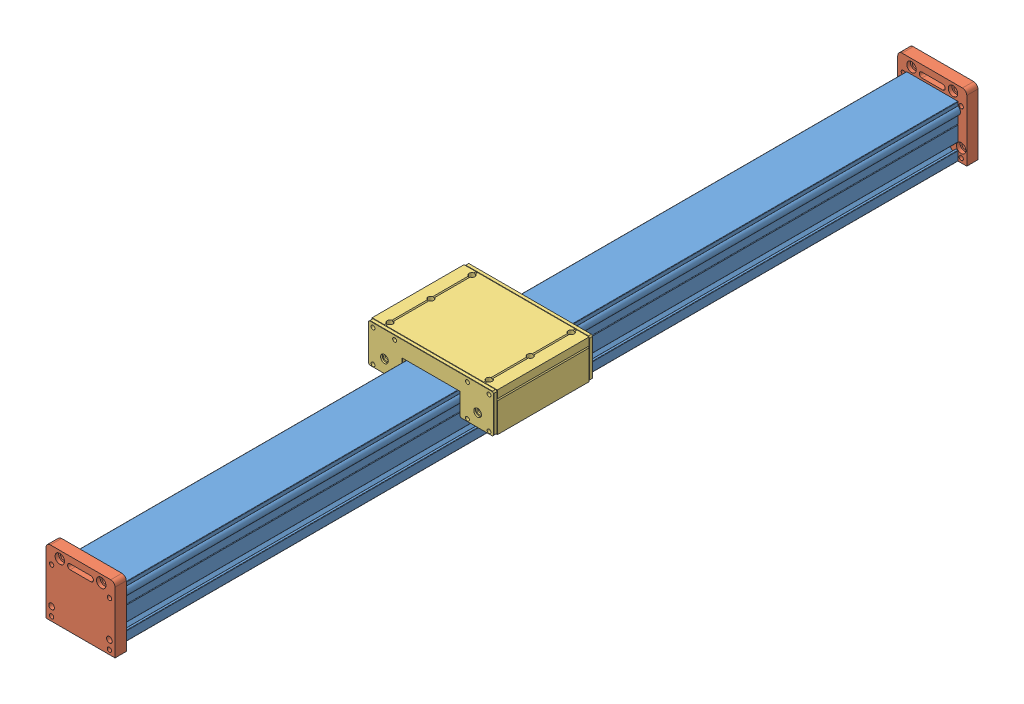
SolidWorks assembly MO_060_115_1000.SLDASM, configuration Standard (file format 3800). Lengths in mm.
Overall size (145 80 1000).
4 component instances, 3 part files, 11 mates.
Components (placement in the parent):
- Profil_MZ060-1: Profil_MZ060.SLDPRT [l=974] at (0 30 0) x (-1 0 0) z (0 0 1) size (65.5 60 974)
- Adapterplatte_MZS060-1: Adapterplatte_MZS060.SLDPRT [Standard] at (0 0 974) size (80 76 13)
- Adapterplatte_MZS060-2: Adapterplatte_MZS060.SLDPRT [Standard] x (-1 0 0) z (0 0 -1) size (80 76 13)
- Schlitten_MO_060_115-1: Schlitten_MO_060_115.SLDPRT [Standard] at (0 0 523.3445) size (145 45 115)
Mates (geometry in assembly coordinates):
- Deckungsgleich1: coincident aligned: plane of Profil_MZ060-1 through (0 30 0) normal (0 0 1)
- Deckungsgleich2: coincident anti-aligned: unknown of Profil_MZ060-1
- Deckungsgleich3: coincident anti-aligned: unknown of Profil_MZ060-1
- Deckungsgleich4: coincident anti-aligned: plane of Adapterplatte_MZS060-2 through (40 0 0) normal (0 0 1); plane of Profil_MZ060-1 through (-30 60 0) normal (0 0 -1)
- Deckungsgleich5: coincident aligned: plane of Profil_MZ060-1 through (-30 0 974) normal (0 -1 0); plane of Adapterplatte_MZS060-2 through (40 0 -13) normal (0 -1 0)
- Breite1: width: plane of Adapterplatte_MZS060-2 through (-40 0 -13) normal (-1 0 0); plane of Adapterplatte_MZS060-2 through (40 0 -13) normal (1 0 0); plane of Profil_MZ060-1 through (-30 60 974) normal (-1 0 0); plane of Profil_MZ060-1 through (30 0 974) normal (1 0 0)
- Deckungsgleich6: coincident anti-aligned: plane of Profil_MZ060-1 through (-30 60 974) normal (0 0 1); plane of Adapterplatte_MZS060-1 through (-40 0 974) normal (0 0 -1)
- Deckungsgleich7: coincident aligned: plane of Profil_MZ060-1 through (-30 0 974) normal (0 -1 0); plane of Adapterplatte_MZS060-1 through (-40 0 987) normal (0 -1 0)
- Breite2: width: plane of Adapterplatte_MZS060-1 through (-40 0 987) normal (-1 0 0); plane of Adapterplatte_MZS060-1 through (40 0 987) normal (1 0 0); plane of Profil_MZ060-1 through (30 0 974) normal (1 0 0); plane of Profil_MZ060-1 through (-30 60 974) normal (-1 0 0)
- Abstand1: distance = 80 mm anti-aligned: plane of Profil_MZ060-1 through (-30 0 974) normal (0 -1 0); plane of Schlitten_MO_060_115-1 through (72.5 80 576.8445) normal (0 1 0)
- Breite3: width: plane of Schlitten_MO_060_115-1 through (-72.5 80 576.8445) normal (-1 0 0); plane of Schlitten_MO_060_115-1 through (72.5 80 576.8445) normal (1 0 0); plane of Profil_MZ060-1 through (-30 60 974) normal (-1 0 0); plane of Profil_MZ060-1 through (30 0 974) normal (1 0 0)
